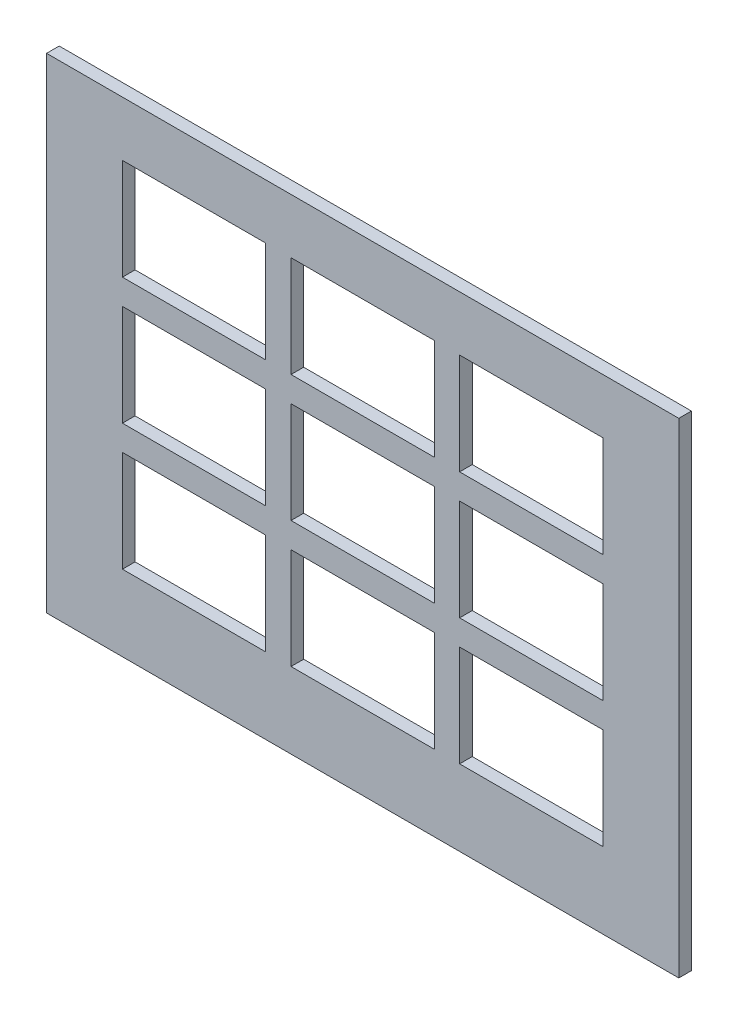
ISO-10303-21;
HEADER;
FILE_DESCRIPTION(('STEP AP214'),'2;1');
FILE_NAME('part.step','',(''),(''),'','','');
FILE_SCHEMA(('AUTOMOTIVE_DESIGN { 1 0 10303 214 1 1 1 1 }'));
ENDSEC;
DATA;
#1=APPLICATION_CONTEXT('core data for automotive mechanical design processes');
#2=APPLICATION_PROTOCOL_DEFINITION('international standard','automotive_design',2000,#1);
#3=PRODUCT_CONTEXT('',#1,'mechanical');
#4=PRODUCT('Part','Part','',(#3));
#5=PRODUCT_RELATED_PRODUCT_CATEGORY('part','',(#4));
#6=PRODUCT_DEFINITION_FORMATION('','',#4);
#7=PRODUCT_DEFINITION_CONTEXT('part definition',#1,'design');
#8=PRODUCT_DEFINITION('design','',#6,#7);
#9=PRODUCT_DEFINITION_SHAPE('','',#8);
#10=(LENGTH_UNIT() NAMED_UNIT(*) SI_UNIT(.MILLI.,.METRE.));
#11=(NAMED_UNIT(*) PLANE_ANGLE_UNIT() SI_UNIT($,.RADIAN.));
#12=(NAMED_UNIT(*) SI_UNIT($,.STERADIAN.) SOLID_ANGLE_UNIT());
#13=UNCERTAINTY_MEASURE_WITH_UNIT(LENGTH_MEASURE(1.E-05),#10,'distance_accuracy_value','');
#14=(GEOMETRIC_REPRESENTATION_CONTEXT(3) GLOBAL_UNCERTAINTY_ASSIGNED_CONTEXT((#13)) GLOBAL_UNIT_ASSIGNED_CONTEXT((#10,
#11,#12)) REPRESENTATION_CONTEXT('',''));
#15=CARTESIAN_POINT('',(0.,0.,0.));
#16=DIRECTION('',(0.,0.,1.));
#17=DIRECTION('',(1.,0.,0.));
#18=AXIS2_PLACEMENT_3D('',#15,#16,#17);
#19=CARTESIAN_POINT('',(0.,115.,3.));
#20=DIRECTION('',(0.,0.,-1.));
#21=DIRECTION('',(-1.,0.,0.));
#22=AXIS2_PLACEMENT_3D('',#19,#20,#21);
#23=PLANE('',#22);
#24=DIRECTION('',(1.,0.,0.));
#25=VECTOR('',#24,1.);
#26=CARTESIAN_POINT('',(17.9999999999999,48.,3.));
#27=LINE('',#26,#25);
#28=CARTESIAN_POINT('',(17.9999999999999,48.,3.));
#29=VERTEX_POINT('',#28);
#30=CARTESIAN_POINT('',(51.9999999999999,48.,3.));
#31=VERTEX_POINT('',#30);
#32=EDGE_CURVE('E330',#29,#31,#27,.T.);
#33=ORIENTED_EDGE('',*,*,#32,.F.);
#34=DIRECTION('',(0.,-1.,0.));
#35=VECTOR('',#34,1.);
#36=CARTESIAN_POINT('',(17.9999999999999,48.,3.));
#37=LINE('',#36,#35);
#38=CARTESIAN_POINT('',(17.9999999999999,72.,3.));
#39=VERTEX_POINT('',#38);
#40=EDGE_CURVE('E337',#39,#29,#37,.T.);
#41=ORIENTED_EDGE('',*,*,#40,.F.);
#42=DIRECTION('',(-1.,0.,0.));
#43=VECTOR('',#42,1.);
#44=CARTESIAN_POINT('',(17.9999999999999,72.,3.));
#45=LINE('',#44,#43);
#46=CARTESIAN_POINT('',(51.9999999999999,72.,3.));
#47=VERTEX_POINT('',#46);
#48=EDGE_CURVE('E334',#47,#39,#45,.T.);
#49=ORIENTED_EDGE('',*,*,#48,.F.);
#50=DIRECTION('',(0.,1.,0.));
#51=VECTOR('',#50,1.);
#52=CARTESIAN_POINT('',(51.9999999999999,48.,3.));
#53=LINE('',#52,#51);
#54=EDGE_CURVE('E332',#31,#47,#53,.T.);
#55=ORIENTED_EDGE('',*,*,#54,.F.);
#56=EDGE_LOOP('',(#33,#41,#49,#55));
#57=FACE_BOUND('',#56,.T.);
#58=DIRECTION('',(-1.,0.,0.));
#59=VECTOR('',#58,1.);
#60=CARTESIAN_POINT('',(91.9999999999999,102.,3.));
#61=LINE('',#60,#59);
#62=CARTESIAN_POINT('',(91.9999999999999,102.,3.));
#63=VERTEX_POINT('',#62);
#64=CARTESIAN_POINT('',(57.9999999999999,102.,3.));
#65=VERTEX_POINT('',#64);
#66=EDGE_CURVE('E392',#63,#65,#61,.T.);
#67=ORIENTED_EDGE('',*,*,#66,.F.);
#68=DIRECTION('',(0.,1.,0.));
#69=VECTOR('',#68,1.);
#70=CARTESIAN_POINT('',(91.9999999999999,102.,3.));
#71=LINE('',#70,#69);
#72=CARTESIAN_POINT('',(91.9999999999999,78.,3.));
#73=VERTEX_POINT('',#72);
#74=EDGE_CURVE('E399',#73,#63,#71,.T.);
#75=ORIENTED_EDGE('',*,*,#74,.F.);
#76=DIRECTION('',(1.,0.,0.));
#77=VECTOR('',#76,1.);
#78=CARTESIAN_POINT('',(91.9999999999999,78.,3.));
#79=LINE('',#78,#77);
#80=CARTESIAN_POINT('',(57.9999999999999,78.,3.));
#81=VERTEX_POINT('',#80);
#82=EDGE_CURVE('E396',#81,#73,#79,.T.);
#83=ORIENTED_EDGE('',*,*,#82,.F.);
#84=DIRECTION('',(0.,-1.,0.));
#85=VECTOR('',#84,1.);
#86=CARTESIAN_POINT('',(57.9999999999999,102.,3.));
#87=LINE('',#86,#85);
#88=EDGE_CURVE('E394',#65,#81,#87,.T.);
#89=ORIENTED_EDGE('',*,*,#88,.F.);
#90=EDGE_LOOP('',(#67,#75,#83,#89));
#91=FACE_BOUND('',#90,.T.);
#92=DIRECTION('',(-1.,0.,0.));
#93=VECTOR('',#92,1.);
#94=CARTESIAN_POINT('',(91.9999999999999,42.,3.));
#95=LINE('',#94,#93);
#96=CARTESIAN_POINT('',(91.9999999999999,42.,3.));
#97=VERTEX_POINT('',#96);
#98=CARTESIAN_POINT('',(57.9999999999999,41.9999999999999,3.));
#99=VERTEX_POINT('',#98);
#100=EDGE_CURVE('E454',#97,#99,#95,.T.);
#101=ORIENTED_EDGE('',*,*,#100,.F.);
#102=DIRECTION('',(0.,1.,0.));
#103=VECTOR('',#102,1.);
#104=CARTESIAN_POINT('',(91.9999999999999,42.,3.));
#105=LINE('',#104,#103);
#106=CARTESIAN_POINT('',(91.9999999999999,18.,3.));
#107=VERTEX_POINT('',#106);
#108=EDGE_CURVE('E461',#107,#97,#105,.T.);
#109=ORIENTED_EDGE('',*,*,#108,.F.);
#110=DIRECTION('',(1.,0.,0.));
#111=VECTOR('',#110,1.);
#112=CARTESIAN_POINT('',(91.9999999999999,18.,3.));
#113=LINE('',#112,#111);
#114=CARTESIAN_POINT('',(57.9999999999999,17.9999999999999,3.));
#115=VERTEX_POINT('',#114);
#116=EDGE_CURVE('E458',#115,#107,#113,.T.);
#117=ORIENTED_EDGE('',*,*,#116,.F.);
#118=DIRECTION('',(0.,-1.,0.));
#119=VECTOR('',#118,1.);
#120=CARTESIAN_POINT('',(57.9999999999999,41.9999999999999,3.));
#121=LINE('',#120,#119);
#122=EDGE_CURVE('E456',#99,#115,#121,.T.);
#123=ORIENTED_EDGE('',*,*,#122,.F.);
#124=EDGE_LOOP('',(#101,#109,#117,#123));
#125=FACE_BOUND('',#124,.T.);
#126=DIRECTION('',(1.,0.,0.));
#127=VECTOR('',#126,1.);
#128=CARTESIAN_POINT('',(97.9999999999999,48.,3.));
#129=LINE('',#128,#127);
#130=CARTESIAN_POINT('',(97.9999999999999,48.,3.));
#131=VERTEX_POINT('',#130);
#132=CARTESIAN_POINT('',(132.,48.,3.));
#133=VERTEX_POINT('',#132);
#134=EDGE_CURVE('E516',#131,#133,#129,.T.);
#135=ORIENTED_EDGE('',*,*,#134,.F.);
#136=DIRECTION('',(0.,-1.,0.));
#137=VECTOR('',#136,1.);
#138=CARTESIAN_POINT('',(97.9999999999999,48.,3.));
#139=LINE('',#138,#137);
#140=CARTESIAN_POINT('',(97.9999999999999,72.,3.));
#141=VERTEX_POINT('',#140);
#142=EDGE_CURVE('E523',#141,#131,#139,.T.);
#143=ORIENTED_EDGE('',*,*,#142,.F.);
#144=DIRECTION('',(-1.,0.,0.));
#145=VECTOR('',#144,1.);
#146=CARTESIAN_POINT('',(97.9999999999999,72.,3.));
#147=LINE('',#146,#145);
#148=CARTESIAN_POINT('',(132.,72.,3.));
#149=VERTEX_POINT('',#148);
#150=EDGE_CURVE('E520',#149,#141,#147,.T.);
#151=ORIENTED_EDGE('',*,*,#150,.F.);
#152=DIRECTION('',(0.,1.,0.));
#153=VECTOR('',#152,1.);
#154=CARTESIAN_POINT('',(132.,48.,3.));
#155=LINE('',#154,#153);
#156=EDGE_CURVE('E518',#133,#149,#155,.T.);
#157=ORIENTED_EDGE('',*,*,#156,.F.);
#158=EDGE_LOOP('',(#135,#143,#151,#157));
#159=FACE_BOUND('',#158,.T.);
#160=DIRECTION('',(0.,-1.,0.));
#161=VECTOR('',#160,1.);
#162=CARTESIAN_POINT('',(0.,0.,3.));
#163=LINE('',#162,#161);
#164=CARTESIAN_POINT('',(0.,115.,3.));
#165=VERTEX_POINT('',#164);
#166=CARTESIAN_POINT('',(0.,0.,3.));
#167=VERTEX_POINT('',#166);
#168=EDGE_CURVE('E575',#165,#167,#163,.T.);
#169=ORIENTED_EDGE('',*,*,#168,.T.);
#170=DIRECTION('',(1.,0.,0.));
#171=VECTOR('',#170,1.);
#172=CARTESIAN_POINT('',(0.,0.,3.));
#173=LINE('',#172,#171);
#174=CARTESIAN_POINT('',(150.,0.,3.));
#175=VERTEX_POINT('',#174);
#176=EDGE_CURVE('E578',#167,#175,#173,.T.);
#177=ORIENTED_EDGE('',*,*,#176,.T.);
#178=DIRECTION('',(0.,1.,0.));
#179=VECTOR('',#178,1.);
#180=CARTESIAN_POINT('',(150.,0.,3.));
#181=LINE('',#180,#179);
#182=CARTESIAN_POINT('',(150.,115.,3.));
#183=VERTEX_POINT('',#182);
#184=EDGE_CURVE('E580',#175,#183,#181,.T.);
#185=ORIENTED_EDGE('',*,*,#184,.T.);
#186=DIRECTION('',(-1.,0.,0.));
#187=VECTOR('',#186,1.);
#188=CARTESIAN_POINT('',(0.,115.,3.));
#189=LINE('',#188,#187);
#190=EDGE_CURVE('E582',#183,#165,#189,.T.);
#191=ORIENTED_EDGE('',*,*,#190,.T.);
#192=EDGE_LOOP('',(#169,#177,#185,#191));
#193=FACE_BOUND('',#192,.T.);
#194=DIRECTION('',(0.,-1.,0.));
#195=VECTOR('',#194,1.);
#196=CARTESIAN_POINT('',(97.9999999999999,102.,3.));
#197=LINE('',#196,#195);
#198=CARTESIAN_POINT('',(97.9999999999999,102.,3.));
#199=VERTEX_POINT('',#198);
#200=CARTESIAN_POINT('',(97.9999999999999,78.,3.));
#201=VERTEX_POINT('',#200);
#202=EDGE_CURVE('E547',#199,#201,#197,.T.);
#203=ORIENTED_EDGE('',*,*,#202,.F.);
#204=DIRECTION('',(-1.,0.,0.));
#205=VECTOR('',#204,1.);
#206=CARTESIAN_POINT('',(97.9999999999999,102.,3.));
#207=LINE('',#206,#205);
#208=CARTESIAN_POINT('',(132.,102.,3.));
#209=VERTEX_POINT('',#208);
#210=EDGE_CURVE('E554',#209,#199,#207,.T.);
#211=ORIENTED_EDGE('',*,*,#210,.F.);
#212=DIRECTION('',(0.,1.,0.));
#213=VECTOR('',#212,1.);
#214=CARTESIAN_POINT('',(132.,102.,3.));
#215=LINE('',#214,#213);
#216=CARTESIAN_POINT('',(132.,78.,3.));
#217=VERTEX_POINT('',#216);
#218=EDGE_CURVE('E551',#217,#209,#215,.T.);
#219=ORIENTED_EDGE('',*,*,#218,.F.);
#220=DIRECTION('',(1.,0.,0.));
#221=VECTOR('',#220,1.);
#222=CARTESIAN_POINT('',(97.9999999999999,78.,3.));
#223=LINE('',#222,#221);
#224=EDGE_CURVE('E549',#201,#217,#223,.T.);
#225=ORIENTED_EDGE('',*,*,#224,.F.);
#226=EDGE_LOOP('',(#203,#211,#219,#225));
#227=FACE_BOUND('',#226,.T.);
#228=DIRECTION('',(0.,-1.,0.));
#229=VECTOR('',#228,1.);
#230=CARTESIAN_POINT('',(97.9999999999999,42.,3.));
#231=LINE('',#230,#229);
#232=CARTESIAN_POINT('',(97.9999999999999,42.,3.));
#233=VERTEX_POINT('',#232);
#234=CARTESIAN_POINT('',(97.9999999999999,18.,3.));
#235=VERTEX_POINT('',#234);
#236=EDGE_CURVE('E485',#233,#235,#231,.T.);
#237=ORIENTED_EDGE('',*,*,#236,.F.);
#238=DIRECTION('',(-1.,0.,0.));
#239=VECTOR('',#238,1.);
#240=CARTESIAN_POINT('',(97.9999999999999,42.,3.));
#241=LINE('',#240,#239);
#242=CARTESIAN_POINT('',(132.,42.,3.));
#243=VERTEX_POINT('',#242);
#244=EDGE_CURVE('E492',#243,#233,#241,.T.);
#245=ORIENTED_EDGE('',*,*,#244,.F.);
#246=DIRECTION('',(0.,1.,0.));
#247=VECTOR('',#246,1.);
#248=CARTESIAN_POINT('',(132.,42.,3.));
#249=LINE('',#248,#247);
#250=CARTESIAN_POINT('',(132.,18.,3.));
#251=VERTEX_POINT('',#250);
#252=EDGE_CURVE('E489',#251,#243,#249,.T.);
#253=ORIENTED_EDGE('',*,*,#252,.F.);
#254=DIRECTION('',(1.,0.,0.));
#255=VECTOR('',#254,1.);
#256=CARTESIAN_POINT('',(97.9999999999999,18.,3.));
#257=LINE('',#256,#255);
#258=EDGE_CURVE('E487',#235,#251,#257,.T.);
#259=ORIENTED_EDGE('',*,*,#258,.F.);
#260=EDGE_LOOP('',(#237,#245,#253,#259));
#261=FACE_BOUND('',#260,.T.);
#262=DIRECTION('',(1.,0.,0.));
#263=VECTOR('',#262,1.);
#264=CARTESIAN_POINT('',(91.9999999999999,48.,3.));
#265=LINE('',#264,#263);
#266=CARTESIAN_POINT('',(57.9999999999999,48.,3.));
#267=VERTEX_POINT('',#266);
#268=CARTESIAN_POINT('',(91.9999999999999,48.,3.));
#269=VERTEX_POINT('',#268);
#270=EDGE_CURVE('E423',#267,#269,#265,.T.);
#271=ORIENTED_EDGE('',*,*,#270,.F.);
#272=DIRECTION('',(0.,-1.,0.));
#273=VECTOR('',#272,1.);
#274=CARTESIAN_POINT('',(57.9999999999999,48.,3.));
#275=LINE('',#274,#273);
#276=CARTESIAN_POINT('',(57.9999999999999,72.,3.));
#277=VERTEX_POINT('',#276);
#278=EDGE_CURVE('E430',#277,#267,#275,.T.);
#279=ORIENTED_EDGE('',*,*,#278,.F.);
#280=DIRECTION('',(-1.,0.,0.));
#281=VECTOR('',#280,1.);
#282=CARTESIAN_POINT('',(91.9999999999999,72.,3.));
#283=LINE('',#282,#281);
#284=CARTESIAN_POINT('',(91.9999999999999,72.,3.));
#285=VERTEX_POINT('',#284);
#286=EDGE_CURVE('E427',#285,#277,#283,.T.);
#287=ORIENTED_EDGE('',*,*,#286,.F.);
#288=DIRECTION('',(0.,1.,0.));
#289=VECTOR('',#288,1.);
#290=CARTESIAN_POINT('',(91.9999999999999,48.,3.));
#291=LINE('',#290,#289);
#292=EDGE_CURVE('E425',#269,#285,#291,.T.);
#293=ORIENTED_EDGE('',*,*,#292,.F.);
#294=EDGE_LOOP('',(#271,#279,#287,#293));
#295=FACE_BOUND('',#294,.T.);
#296=DIRECTION('',(-1.,0.,0.));
#297=VECTOR('',#296,1.);
#298=CARTESIAN_POINT('',(17.9999999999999,41.9999999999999,3.));
#299=LINE('',#298,#297);
#300=CARTESIAN_POINT('',(51.9999999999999,41.9999999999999,3.));
#301=VERTEX_POINT('',#300);
#302=CARTESIAN_POINT('',(17.9999999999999,41.9999999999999,3.));
#303=VERTEX_POINT('',#302);
#304=EDGE_CURVE('E361',#301,#303,#299,.T.);
#305=ORIENTED_EDGE('',*,*,#304,.F.);
#306=DIRECTION('',(0.,1.,0.));
#307=VECTOR('',#306,1.);
#308=CARTESIAN_POINT('',(51.9999999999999,41.9999999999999,3.));
#309=LINE('',#308,#307);
#310=CARTESIAN_POINT('',(51.9999999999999,17.9999999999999,3.));
#311=VERTEX_POINT('',#310);
#312=EDGE_CURVE('E368',#311,#301,#309,.T.);
#313=ORIENTED_EDGE('',*,*,#312,.F.);
#314=DIRECTION('',(1.,0.,0.));
#315=VECTOR('',#314,1.);
#316=CARTESIAN_POINT('',(17.9999999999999,17.9999999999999,3.));
#317=LINE('',#316,#315);
#318=CARTESIAN_POINT('',(17.9999999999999,17.9999999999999,3.));
#319=VERTEX_POINT('',#318);
#320=EDGE_CURVE('E365',#319,#311,#317,.T.);
#321=ORIENTED_EDGE('',*,*,#320,.F.);
#322=DIRECTION('',(0.,-1.,0.));
#323=VECTOR('',#322,1.);
#324=CARTESIAN_POINT('',(17.9999999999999,41.9999999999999,3.));
#325=LINE('',#324,#323);
#326=EDGE_CURVE('E363',#303,#319,#325,.T.);
#327=ORIENTED_EDGE('',*,*,#326,.F.);
#328=EDGE_LOOP('',(#305,#313,#321,#327));
#329=FACE_BOUND('',#328,.T.);
#330=DIRECTION('',(-1.,0.,0.));
#331=VECTOR('',#330,1.);
#332=CARTESIAN_POINT('',(17.9999999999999,102.,3.));
#333=LINE('',#332,#331);
#334=CARTESIAN_POINT('',(51.9999999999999,102.,3.));
#335=VERTEX_POINT('',#334);
#336=CARTESIAN_POINT('',(17.9999999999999,102.,3.));
#337=VERTEX_POINT('',#336);
#338=EDGE_CURVE('E298',#335,#337,#333,.T.);
#339=ORIENTED_EDGE('',*,*,#338,.F.);
#340=DIRECTION('',(0.,1.,0.));
#341=VECTOR('',#340,1.);
#342=CARTESIAN_POINT('',(51.9999999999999,102.,3.));
#343=LINE('',#342,#341);
#344=CARTESIAN_POINT('',(51.9999999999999,78.,3.));
#345=VERTEX_POINT('',#344);
#346=EDGE_CURVE('E313',#345,#335,#343,.T.);
#347=ORIENTED_EDGE('',*,*,#346,.F.);
#348=DIRECTION('',(1.,0.,0.));
#349=VECTOR('',#348,1.);
#350=CARTESIAN_POINT('',(17.9999999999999,78.,3.));
#351=LINE('',#350,#349);
#352=CARTESIAN_POINT('',(17.9999999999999,78.,3.));
#353=VERTEX_POINT('',#352);
#354=EDGE_CURVE('E311',#353,#345,#351,.T.);
#355=ORIENTED_EDGE('',*,*,#354,.F.);
#356=DIRECTION('',(0.,-1.,0.));
#357=VECTOR('',#356,1.);
#358=CARTESIAN_POINT('',(17.9999999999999,102.,3.));
#359=LINE('',#358,#357);
#360=EDGE_CURVE('E309',#337,#353,#359,.T.);
#361=ORIENTED_EDGE('',*,*,#360,.F.);
#362=EDGE_LOOP('',(#339,#347,#355,#361));
#363=FACE_BOUND('',#362,.T.);
#364=ADVANCED_FACE('F26',(#57,#91,#125,#159,#193,#227,#261,#295,#329,#363),#23,.F.);
#365=CARTESIAN_POINT('',(0.,115.,0.));
#366=DIRECTION('',(0.,0.,-1.));
#367=DIRECTION('',(-1.,0.,0.));
#368=AXIS2_PLACEMENT_3D('',#365,#366,#367);
#369=PLANE('',#368);
#370=DIRECTION('',(0.,-1.,0.));
#371=VECTOR('',#370,1.);
#372=CARTESIAN_POINT('',(17.9999999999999,48.,0.));
#373=LINE('',#372,#371);
#374=CARTESIAN_POINT('',(17.9999999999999,72.,0.));
#375=VERTEX_POINT('',#374);
#376=CARTESIAN_POINT('',(17.9999999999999,48.,0.));
#377=VERTEX_POINT('',#376);
#378=EDGE_CURVE('E327',#375,#377,#373,.T.);
#379=ORIENTED_EDGE('',*,*,#378,.T.);
#380=DIRECTION('',(1.,0.,0.));
#381=VECTOR('',#380,1.);
#382=CARTESIAN_POINT('',(17.9999999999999,48.,0.));
#383=LINE('',#382,#381);
#384=CARTESIAN_POINT('',(51.9999999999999,48.,0.));
#385=VERTEX_POINT('',#384);
#386=EDGE_CURVE('E299',#377,#385,#383,.T.);
#387=ORIENTED_EDGE('',*,*,#386,.T.);
#388=DIRECTION('',(0.,1.,0.));
#389=VECTOR('',#388,1.);
#390=CARTESIAN_POINT('',(51.9999999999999,48.,0.));
#391=LINE('',#390,#389);
#392=CARTESIAN_POINT('',(51.9999999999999,72.,0.));
#393=VERTEX_POINT('',#392);
#394=EDGE_CURVE('E321',#385,#393,#391,.T.);
#395=ORIENTED_EDGE('',*,*,#394,.T.);
#396=DIRECTION('',(-1.,0.,0.));
#397=VECTOR('',#396,1.);
#398=CARTESIAN_POINT('',(17.9999999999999,72.,0.));
#399=LINE('',#398,#397);
#400=EDGE_CURVE('E324',#393,#375,#399,.T.);
#401=ORIENTED_EDGE('',*,*,#400,.T.);
#402=EDGE_LOOP('',(#379,#387,#395,#401));
#403=FACE_BOUND('',#402,.T.);
#404=DIRECTION('',(0.,1.,0.));
#405=VECTOR('',#404,1.);
#406=CARTESIAN_POINT('',(91.9999999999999,102.,0.));
#407=LINE('',#406,#405);
#408=CARTESIAN_POINT('',(91.9999999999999,78.,0.));
#409=VERTEX_POINT('',#408);
#410=CARTESIAN_POINT('',(91.9999999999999,102.,0.));
#411=VERTEX_POINT('',#410);
#412=EDGE_CURVE('E389',#409,#411,#407,.T.);
#413=ORIENTED_EDGE('',*,*,#412,.T.);
#414=DIRECTION('',(-1.,0.,0.));
#415=VECTOR('',#414,1.);
#416=CARTESIAN_POINT('',(91.9999999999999,102.,0.));
#417=LINE('',#416,#415);
#418=CARTESIAN_POINT('',(57.9999999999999,102.,0.));
#419=VERTEX_POINT('',#418);
#420=EDGE_CURVE('E380',#411,#419,#417,.T.);
#421=ORIENTED_EDGE('',*,*,#420,.T.);
#422=DIRECTION('',(0.,-1.,0.));
#423=VECTOR('',#422,1.);
#424=CARTESIAN_POINT('',(57.9999999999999,102.,0.));
#425=LINE('',#424,#423);
#426=CARTESIAN_POINT('',(57.9999999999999,78.,0.));
#427=VERTEX_POINT('',#426);
#428=EDGE_CURVE('E383',#419,#427,#425,.T.);
#429=ORIENTED_EDGE('',*,*,#428,.T.);
#430=DIRECTION('',(1.,0.,0.));
#431=VECTOR('',#430,1.);
#432=CARTESIAN_POINT('',(91.9999999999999,78.,0.));
#433=LINE('',#432,#431);
#434=EDGE_CURVE('E386',#427,#409,#433,.T.);
#435=ORIENTED_EDGE('',*,*,#434,.T.);
#436=EDGE_LOOP('',(#413,#421,#429,#435));
#437=FACE_BOUND('',#436,.T.);
#438=DIRECTION('',(0.,1.,0.));
#439=VECTOR('',#438,1.);
#440=CARTESIAN_POINT('',(91.9999999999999,42.,0.));
#441=LINE('',#440,#439);
#442=CARTESIAN_POINT('',(91.9999999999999,18.,0.));
#443=VERTEX_POINT('',#442);
#444=CARTESIAN_POINT('',(91.9999999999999,42.,0.));
#445=VERTEX_POINT('',#444);
#446=EDGE_CURVE('E451',#443,#445,#441,.T.);
#447=ORIENTED_EDGE('',*,*,#446,.T.);
#448=DIRECTION('',(-1.,0.,0.));
#449=VECTOR('',#448,1.);
#450=CARTESIAN_POINT('',(91.9999999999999,42.,0.));
#451=LINE('',#450,#449);
#452=CARTESIAN_POINT('',(57.9999999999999,41.9999999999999,0.));
#453=VERTEX_POINT('',#452);
#454=EDGE_CURVE('E442',#445,#453,#451,.T.);
#455=ORIENTED_EDGE('',*,*,#454,.T.);
#456=DIRECTION('',(0.,-1.,0.));
#457=VECTOR('',#456,1.);
#458=CARTESIAN_POINT('',(57.9999999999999,41.9999999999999,0.));
#459=LINE('',#458,#457);
#460=CARTESIAN_POINT('',(57.9999999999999,17.9999999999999,0.));
#461=VERTEX_POINT('',#460);
#462=EDGE_CURVE('E445',#453,#461,#459,.T.);
#463=ORIENTED_EDGE('',*,*,#462,.T.);
#464=DIRECTION('',(1.,0.,0.));
#465=VECTOR('',#464,1.);
#466=CARTESIAN_POINT('',(91.9999999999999,18.,0.));
#467=LINE('',#466,#465);
#468=EDGE_CURVE('E448',#461,#443,#467,.T.);
#469=ORIENTED_EDGE('',*,*,#468,.T.);
#470=EDGE_LOOP('',(#447,#455,#463,#469));
#471=FACE_BOUND('',#470,.T.);
#472=DIRECTION('',(0.,-1.,0.));
#473=VECTOR('',#472,1.);
#474=CARTESIAN_POINT('',(97.9999999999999,48.,0.));
#475=LINE('',#474,#473);
#476=CARTESIAN_POINT('',(97.9999999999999,72.,0.));
#477=VERTEX_POINT('',#476);
#478=CARTESIAN_POINT('',(97.9999999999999,48.,0.));
#479=VERTEX_POINT('',#478);
#480=EDGE_CURVE('E513',#477,#479,#475,.T.);
#481=ORIENTED_EDGE('',*,*,#480,.T.);
#482=DIRECTION('',(1.,0.,0.));
#483=VECTOR('',#482,1.);
#484=CARTESIAN_POINT('',(97.9999999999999,48.,0.));
#485=LINE('',#484,#483);
#486=CARTESIAN_POINT('',(132.,48.,0.));
#487=VERTEX_POINT('',#486);
#488=EDGE_CURVE('E504',#479,#487,#485,.T.);
#489=ORIENTED_EDGE('',*,*,#488,.T.);
#490=DIRECTION('',(0.,1.,0.));
#491=VECTOR('',#490,1.);
#492=CARTESIAN_POINT('',(132.,48.,0.));
#493=LINE('',#492,#491);
#494=CARTESIAN_POINT('',(132.,72.,0.));
#495=VERTEX_POINT('',#494);
#496=EDGE_CURVE('E507',#487,#495,#493,.T.);
#497=ORIENTED_EDGE('',*,*,#496,.T.);
#498=DIRECTION('',(-1.,0.,0.));
#499=VECTOR('',#498,1.);
#500=CARTESIAN_POINT('',(97.9999999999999,72.,0.));
#501=LINE('',#500,#499);
#502=EDGE_CURVE('E510',#495,#477,#501,.T.);
#503=ORIENTED_EDGE('',*,*,#502,.T.);
#504=EDGE_LOOP('',(#481,#489,#497,#503));
#505=FACE_BOUND('',#504,.T.);
#506=DIRECTION('',(0.,-1.,0.));
#507=VECTOR('',#506,1.);
#508=CARTESIAN_POINT('',(0.,0.,0.));
#509=LINE('',#508,#507);
#510=CARTESIAN_POINT('',(0.,115.,0.));
#511=VERTEX_POINT('',#510);
#512=CARTESIAN_POINT('',(0.,0.,0.));
#513=VERTEX_POINT('',#512);
#514=EDGE_CURVE('E566',#511,#513,#509,.T.);
#515=ORIENTED_EDGE('',*,*,#514,.F.);
#516=DIRECTION('',(-1.,0.,0.));
#517=VECTOR('',#516,1.);
#518=CARTESIAN_POINT('',(0.,115.,0.));
#519=LINE('',#518,#517);
#520=CARTESIAN_POINT('',(150.,115.,0.));
#521=VERTEX_POINT('',#520);
#522=EDGE_CURVE('E573',#521,#511,#519,.T.);
#523=ORIENTED_EDGE('',*,*,#522,.F.);
#524=DIRECTION('',(0.,1.,0.));
#525=VECTOR('',#524,1.);
#526=CARTESIAN_POINT('',(150.,0.,0.));
#527=LINE('',#526,#525);
#528=CARTESIAN_POINT('',(150.,0.,0.));
#529=VERTEX_POINT('',#528);
#530=EDGE_CURVE('E571',#529,#521,#527,.T.);
#531=ORIENTED_EDGE('',*,*,#530,.F.);
#532=DIRECTION('',(1.,0.,0.));
#533=VECTOR('',#532,1.);
#534=CARTESIAN_POINT('',(0.,0.,0.));
#535=LINE('',#534,#533);
#536=EDGE_CURVE('E569',#513,#529,#535,.T.);
#537=ORIENTED_EDGE('',*,*,#536,.F.);
#538=EDGE_LOOP('',(#515,#523,#531,#537));
#539=FACE_BOUND('',#538,.T.);
#540=DIRECTION('',(-1.,0.,0.));
#541=VECTOR('',#540,1.);
#542=CARTESIAN_POINT('',(97.9999999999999,102.,0.));
#543=LINE('',#542,#541);
#544=CARTESIAN_POINT('',(132.,102.,0.));
#545=VERTEX_POINT('',#544);
#546=CARTESIAN_POINT('',(97.9999999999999,102.,0.));
#547=VERTEX_POINT('',#546);
#548=EDGE_CURVE('E544',#545,#547,#543,.T.);
#549=ORIENTED_EDGE('',*,*,#548,.T.);
#550=DIRECTION('',(0.,-1.,0.));
#551=VECTOR('',#550,1.);
#552=CARTESIAN_POINT('',(97.9999999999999,102.,0.));
#553=LINE('',#552,#551);
#554=CARTESIAN_POINT('',(97.9999999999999,78.,0.));
#555=VERTEX_POINT('',#554);
#556=EDGE_CURVE('E535',#547,#555,#553,.T.);
#557=ORIENTED_EDGE('',*,*,#556,.T.);
#558=DIRECTION('',(1.,0.,0.));
#559=VECTOR('',#558,1.);
#560=CARTESIAN_POINT('',(97.9999999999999,78.,0.));
#561=LINE('',#560,#559);
#562=CARTESIAN_POINT('',(132.,78.,0.));
#563=VERTEX_POINT('',#562);
#564=EDGE_CURVE('E538',#555,#563,#561,.T.);
#565=ORIENTED_EDGE('',*,*,#564,.T.);
#566=DIRECTION('',(0.,1.,0.));
#567=VECTOR('',#566,1.);
#568=CARTESIAN_POINT('',(132.,102.,0.));
#569=LINE('',#568,#567);
#570=EDGE_CURVE('E541',#563,#545,#569,.T.);
#571=ORIENTED_EDGE('',*,*,#570,.T.);
#572=EDGE_LOOP('',(#549,#557,#565,#571));
#573=FACE_BOUND('',#572,.T.);
#574=DIRECTION('',(-1.,0.,0.));
#575=VECTOR('',#574,1.);
#576=CARTESIAN_POINT('',(97.9999999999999,42.,0.));
#577=LINE('',#576,#575);
#578=CARTESIAN_POINT('',(132.,42.,0.));
#579=VERTEX_POINT('',#578);
#580=CARTESIAN_POINT('',(97.9999999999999,42.,0.));
#581=VERTEX_POINT('',#580);
#582=EDGE_CURVE('E482',#579,#581,#577,.T.);
#583=ORIENTED_EDGE('',*,*,#582,.T.);
#584=DIRECTION('',(0.,-1.,0.));
#585=VECTOR('',#584,1.);
#586=CARTESIAN_POINT('',(97.9999999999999,42.,0.));
#587=LINE('',#586,#585);
#588=CARTESIAN_POINT('',(97.9999999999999,18.,0.));
#589=VERTEX_POINT('',#588);
#590=EDGE_CURVE('E473',#581,#589,#587,.T.);
#591=ORIENTED_EDGE('',*,*,#590,.T.);
#592=DIRECTION('',(1.,0.,0.));
#593=VECTOR('',#592,1.);
#594=CARTESIAN_POINT('',(97.9999999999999,18.,0.));
#595=LINE('',#594,#593);
#596=CARTESIAN_POINT('',(132.,18.,0.));
#597=VERTEX_POINT('',#596);
#598=EDGE_CURVE('E476',#589,#597,#595,.T.);
#599=ORIENTED_EDGE('',*,*,#598,.T.);
#600=DIRECTION('',(0.,1.,0.));
#601=VECTOR('',#600,1.);
#602=CARTESIAN_POINT('',(132.,42.,0.));
#603=LINE('',#602,#601);
#604=EDGE_CURVE('E479',#597,#579,#603,.T.);
#605=ORIENTED_EDGE('',*,*,#604,.T.);
#606=EDGE_LOOP('',(#583,#591,#599,#605));
#607=FACE_BOUND('',#606,.T.);
#608=DIRECTION('',(0.,-1.,0.));
#609=VECTOR('',#608,1.);
#610=CARTESIAN_POINT('',(57.9999999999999,48.,0.));
#611=LINE('',#610,#609);
#612=CARTESIAN_POINT('',(57.9999999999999,72.,0.));
#613=VERTEX_POINT('',#612);
#614=CARTESIAN_POINT('',(57.9999999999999,48.,0.));
#615=VERTEX_POINT('',#614);
#616=EDGE_CURVE('E420',#613,#615,#611,.T.);
#617=ORIENTED_EDGE('',*,*,#616,.T.);
#618=DIRECTION('',(1.,0.,0.));
#619=VECTOR('',#618,1.);
#620=CARTESIAN_POINT('',(91.9999999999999,48.,0.));
#621=LINE('',#620,#619);
#622=CARTESIAN_POINT('',(91.9999999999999,48.,0.));
#623=VERTEX_POINT('',#622);
#624=EDGE_CURVE('E411',#615,#623,#621,.T.);
#625=ORIENTED_EDGE('',*,*,#624,.T.);
#626=DIRECTION('',(0.,1.,0.));
#627=VECTOR('',#626,1.);
#628=CARTESIAN_POINT('',(91.9999999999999,48.,0.));
#629=LINE('',#628,#627);
#630=CARTESIAN_POINT('',(91.9999999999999,72.,0.));
#631=VERTEX_POINT('',#630);
#632=EDGE_CURVE('E414',#623,#631,#629,.T.);
#633=ORIENTED_EDGE('',*,*,#632,.T.);
#634=DIRECTION('',(-1.,0.,0.));
#635=VECTOR('',#634,1.);
#636=CARTESIAN_POINT('',(91.9999999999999,72.,0.));
#637=LINE('',#636,#635);
#638=EDGE_CURVE('E417',#631,#613,#637,.T.);
#639=ORIENTED_EDGE('',*,*,#638,.T.);
#640=EDGE_LOOP('',(#617,#625,#633,#639));
#641=FACE_BOUND('',#640,.T.);
#642=DIRECTION('',(0.,1.,0.));
#643=VECTOR('',#642,1.);
#644=CARTESIAN_POINT('',(51.9999999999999,41.9999999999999,0.));
#645=LINE('',#644,#643);
#646=CARTESIAN_POINT('',(51.9999999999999,17.9999999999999,0.));
#647=VERTEX_POINT('',#646);
#648=CARTESIAN_POINT('',(51.9999999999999,41.9999999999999,0.));
#649=VERTEX_POINT('',#648);
#650=EDGE_CURVE('E358',#647,#649,#645,.T.);
#651=ORIENTED_EDGE('',*,*,#650,.T.);
#652=DIRECTION('',(-1.,0.,0.));
#653=VECTOR('',#652,1.);
#654=CARTESIAN_POINT('',(17.9999999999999,41.9999999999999,0.));
#655=LINE('',#654,#653);
#656=CARTESIAN_POINT('',(17.9999999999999,41.9999999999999,0.));
#657=VERTEX_POINT('',#656);
#658=EDGE_CURVE('E349',#649,#657,#655,.T.);
#659=ORIENTED_EDGE('',*,*,#658,.T.);
#660=DIRECTION('',(0.,-1.,0.));
#661=VECTOR('',#660,1.);
#662=CARTESIAN_POINT('',(17.9999999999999,41.9999999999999,0.));
#663=LINE('',#662,#661);
#664=CARTESIAN_POINT('',(17.9999999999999,17.9999999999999,0.));
#665=VERTEX_POINT('',#664);
#666=EDGE_CURVE('E352',#657,#665,#663,.T.);
#667=ORIENTED_EDGE('',*,*,#666,.T.);
#668=DIRECTION('',(1.,0.,0.));
#669=VECTOR('',#668,1.);
#670=CARTESIAN_POINT('',(17.9999999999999,17.9999999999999,0.));
#671=LINE('',#670,#669);
#672=EDGE_CURVE('E355',#665,#647,#671,.T.);
#673=ORIENTED_EDGE('',*,*,#672,.T.);
#674=EDGE_LOOP('',(#651,#659,#667,#673));
#675=FACE_BOUND('',#674,.T.);
#676=DIRECTION('',(0.,1.,0.));
#677=VECTOR('',#676,1.);
#678=CARTESIAN_POINT('',(51.9999999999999,102.,0.));
#679=LINE('',#678,#677);
#680=CARTESIAN_POINT('',(51.9999999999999,78.,0.));
#681=VERTEX_POINT('',#680);
#682=CARTESIAN_POINT('',(51.9999999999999,102.,0.));
#683=VERTEX_POINT('',#682);
#684=EDGE_CURVE('E303',#681,#683,#679,.T.);
#685=ORIENTED_EDGE('',*,*,#684,.T.);
#686=DIRECTION('',(-1.,0.,0.));
#687=VECTOR('',#686,1.);
#688=CARTESIAN_POINT('',(17.9999999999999,102.,0.));
#689=LINE('',#688,#687);
#690=CARTESIAN_POINT('',(17.9999999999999,102.,0.));
#691=VERTEX_POINT('',#690);
#692=EDGE_CURVE('E49',#683,#691,#689,.T.);
#693=ORIENTED_EDGE('',*,*,#692,.T.);
#694=DIRECTION('',(0.,-1.,0.));
#695=VECTOR('',#694,1.);
#696=CARTESIAN_POINT('',(17.9999999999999,102.,0.));
#697=LINE('',#696,#695);
#698=CARTESIAN_POINT('',(17.9999999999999,78.,0.));
#699=VERTEX_POINT('',#698);
#700=EDGE_CURVE('E285',#691,#699,#697,.T.);
#701=ORIENTED_EDGE('',*,*,#700,.T.);
#702=DIRECTION('',(1.,0.,0.));
#703=VECTOR('',#702,1.);
#704=CARTESIAN_POINT('',(17.9999999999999,78.,0.));
#705=LINE('',#704,#703);
#706=EDGE_CURVE('E294',#699,#681,#705,.T.);
#707=ORIENTED_EDGE('',*,*,#706,.T.);
#708=EDGE_LOOP('',(#685,#693,#701,#707));
#709=FACE_BOUND('',#708,.T.);
#710=ADVANCED_FACE('F302',(#403,#437,#471,#505,#539,#573,#607,#641,#675,#709),#369,.T.);
#711=CARTESIAN_POINT('',(0.,0.,3.));
#712=DIRECTION('',(1.,0.,0.));
#713=DIRECTION('',(0.,0.,-1.));
#714=AXIS2_PLACEMENT_3D('',#711,#712,#713);
#715=PLANE('',#714);
#716=ORIENTED_EDGE('',*,*,#514,.T.);
#717=DIRECTION('',(0.,0.,-1.));
#718=VECTOR('',#717,1.);
#719=CARTESIAN_POINT('',(0.,0.,3.));
#720=LINE('',#719,#718);
#721=EDGE_CURVE('E11',#167,#513,#720,.T.);
#722=ORIENTED_EDGE('',*,*,#721,.F.);
#723=ORIENTED_EDGE('',*,*,#168,.F.);
#724=DIRECTION('',(0.,0.,-1.));
#725=VECTOR('',#724,1.);
#726=CARTESIAN_POINT('',(0.,115.,3.));
#727=LINE('',#726,#725);
#728=EDGE_CURVE('E584',#165,#511,#727,.T.);
#729=ORIENTED_EDGE('',*,*,#728,.T.);
#730=EDGE_LOOP('',(#716,#722,#723,#729));
#731=FACE_BOUND('',#730,.T.);
#732=ADVANCED_FACE('F28',(#731),#715,.F.);
#733=CARTESIAN_POINT('',(0.,0.,3.));
#734=DIRECTION('',(0.,1.,0.));
#735=DIRECTION('',(0.,0.,1.));
#736=AXIS2_PLACEMENT_3D('',#733,#734,#735);
#737=PLANE('',#736);
#738=ORIENTED_EDGE('',*,*,#536,.T.);
#739=DIRECTION('',(0.,0.,-1.));
#740=VECTOR('',#739,1.);
#741=CARTESIAN_POINT('',(150.,0.,3.));
#742=LINE('',#741,#740);
#743=EDGE_CURVE('E34',#175,#529,#742,.T.);
#744=ORIENTED_EDGE('',*,*,#743,.F.);
#745=ORIENTED_EDGE('',*,*,#176,.F.);
#746=ORIENTED_EDGE('',*,*,#721,.T.);
#747=EDGE_LOOP('',(#738,#744,#745,#746));
#748=FACE_BOUND('',#747,.T.);
#749=ADVANCED_FACE('F610',(#748),#737,.F.);
#750=CARTESIAN_POINT('',(150.,0.,3.));
#751=DIRECTION('',(-1.,0.,0.));
#752=DIRECTION('',(0.,0.,1.));
#753=AXIS2_PLACEMENT_3D('',#750,#751,#752);
#754=PLANE('',#753);
#755=ORIENTED_EDGE('',*,*,#530,.T.);
#756=DIRECTION('',(0.,0.,-1.));
#757=VECTOR('',#756,1.);
#758=CARTESIAN_POINT('',(150.,115.,3.));
#759=LINE('',#758,#757);
#760=EDGE_CURVE('E587',#183,#521,#759,.T.);
#761=ORIENTED_EDGE('',*,*,#760,.F.);
#762=ORIENTED_EDGE('',*,*,#184,.F.);
#763=ORIENTED_EDGE('',*,*,#743,.T.);
#764=EDGE_LOOP('',(#755,#761,#762,#763));
#765=FACE_BOUND('',#764,.T.);
#766=ADVANCED_FACE('F594',(#765),#754,.F.);
#767=CARTESIAN_POINT('',(0.,115.,3.));
#768=DIRECTION('',(0.,-1.,0.));
#769=DIRECTION('',(0.,0.,-1.));
#770=AXIS2_PLACEMENT_3D('',#767,#768,#769);
#771=PLANE('',#770);
#772=ORIENTED_EDGE('',*,*,#522,.T.);
#773=ORIENTED_EDGE('',*,*,#728,.F.);
#774=ORIENTED_EDGE('',*,*,#190,.F.);
#775=ORIENTED_EDGE('',*,*,#760,.T.);
#776=EDGE_LOOP('',(#772,#773,#774,#775));
#777=FACE_BOUND('',#776,.T.);
#778=ADVANCED_FACE('F603',(#777),#771,.F.);
#779=CARTESIAN_POINT('',(97.9999999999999,102.,3.));
#780=DIRECTION('',(1.,0.,0.));
#781=DIRECTION('',(0.,0.,-1.));
#782=AXIS2_PLACEMENT_3D('',#779,#780,#781);
#783=PLANE('',#782);
#784=ORIENTED_EDGE('',*,*,#556,.F.);
#785=DIRECTION('',(0.,0.,-1.));
#786=VECTOR('',#785,1.);
#787=CARTESIAN_POINT('',(97.9999999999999,102.,3.));
#788=LINE('',#787,#786);
#789=EDGE_CURVE('E556',#199,#547,#788,.T.);
#790=ORIENTED_EDGE('',*,*,#789,.F.);
#791=ORIENTED_EDGE('',*,*,#202,.T.);
#792=DIRECTION('',(0.,0.,-1.));
#793=VECTOR('',#792,1.);
#794=CARTESIAN_POINT('',(97.9999999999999,78.,3.));
#795=LINE('',#794,#793);
#796=EDGE_CURVE('E563',#201,#555,#795,.T.);
#797=ORIENTED_EDGE('',*,*,#796,.T.);
#798=EDGE_LOOP('',(#784,#790,#791,#797));
#799=FACE_BOUND('',#798,.T.);
#800=ADVANCED_FACE('F630',(#799),#783,.T.);
#801=CARTESIAN_POINT('',(97.9999999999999,78.,3.));
#802=DIRECTION('',(0.,1.,0.));
#803=DIRECTION('',(0.,0.,1.));
#804=AXIS2_PLACEMENT_3D('',#801,#802,#803);
#805=PLANE('',#804);
#806=ORIENTED_EDGE('',*,*,#564,.F.);
#807=ORIENTED_EDGE('',*,*,#796,.F.);
#808=ORIENTED_EDGE('',*,*,#224,.T.);
#809=DIRECTION('',(0.,0.,-1.));
#810=VECTOR('',#809,1.);
#811=CARTESIAN_POINT('',(132.,78.,3.));
#812=LINE('',#811,#810);
#813=EDGE_CURVE('E561',#217,#563,#812,.T.);
#814=ORIENTED_EDGE('',*,*,#813,.T.);
#815=EDGE_LOOP('',(#806,#807,#808,#814));
#816=FACE_BOUND('',#815,.T.);
#817=ADVANCED_FACE('F634',(#816),#805,.T.);
#818=CARTESIAN_POINT('',(132.,102.,3.));
#819=DIRECTION('',(-1.,0.,0.));
#820=DIRECTION('',(0.,0.,1.));
#821=AXIS2_PLACEMENT_3D('',#818,#819,#820);
#822=PLANE('',#821);
#823=ORIENTED_EDGE('',*,*,#570,.F.);
#824=ORIENTED_EDGE('',*,*,#813,.F.);
#825=ORIENTED_EDGE('',*,*,#218,.T.);
#826=DIRECTION('',(0.,0.,-1.));
#827=VECTOR('',#826,1.);
#828=CARTESIAN_POINT('',(132.,102.,3.));
#829=LINE('',#828,#827);
#830=EDGE_CURVE('E559',#209,#545,#829,.T.);
#831=ORIENTED_EDGE('',*,*,#830,.T.);
#832=EDGE_LOOP('',(#823,#824,#825,#831));
#833=FACE_BOUND('',#832,.T.);
#834=ADVANCED_FACE('F639',(#833),#822,.T.);
#835=CARTESIAN_POINT('',(97.9999999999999,102.,3.));
#836=DIRECTION('',(0.,-1.,0.));
#837=DIRECTION('',(0.,0.,-1.));
#838=AXIS2_PLACEMENT_3D('',#835,#836,#837);
#839=PLANE('',#838);
#840=ORIENTED_EDGE('',*,*,#548,.F.);
#841=ORIENTED_EDGE('',*,*,#830,.F.);
#842=ORIENTED_EDGE('',*,*,#210,.T.);
#843=ORIENTED_EDGE('',*,*,#789,.T.);
#844=EDGE_LOOP('',(#840,#841,#842,#843));
#845=FACE_BOUND('',#844,.T.);
#846=ADVANCED_FACE('F645',(#845),#839,.T.);
#847=CARTESIAN_POINT('',(97.9999999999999,48.,3.));
#848=DIRECTION('',(0.,1.,0.));
#849=DIRECTION('',(0.,0.,1.));
#850=AXIS2_PLACEMENT_3D('',#847,#848,#849);
#851=PLANE('',#850);
#852=ORIENTED_EDGE('',*,*,#488,.F.);
#853=DIRECTION('',(0.,0.,-1.));
#854=VECTOR('',#853,1.);
#855=CARTESIAN_POINT('',(97.9999999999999,48.,3.));
#856=LINE('',#855,#854);
#857=EDGE_CURVE('E525',#131,#479,#856,.T.);
#858=ORIENTED_EDGE('',*,*,#857,.F.);
#859=ORIENTED_EDGE('',*,*,#134,.T.);
#860=DIRECTION('',(0.,0.,-1.));
#861=VECTOR('',#860,1.);
#862=CARTESIAN_POINT('',(132.,48.,3.));
#863=LINE('',#862,#861);
#864=EDGE_CURVE('E532',#133,#487,#863,.T.);
#865=ORIENTED_EDGE('',*,*,#864,.T.);
#866=EDGE_LOOP('',(#852,#858,#859,#865));
#867=FACE_BOUND('',#866,.T.);
#868=ADVANCED_FACE('F649',(#867),#851,.T.);
#869=CARTESIAN_POINT('',(132.,48.,3.));
#870=DIRECTION('',(-1.,0.,0.));
#871=DIRECTION('',(0.,0.,1.));
#872=AXIS2_PLACEMENT_3D('',#869,#870,#871);
#873=PLANE('',#872);
#874=ORIENTED_EDGE('',*,*,#496,.F.);
#875=ORIENTED_EDGE('',*,*,#864,.F.);
#876=ORIENTED_EDGE('',*,*,#156,.T.);
#877=DIRECTION('',(0.,0.,-1.));
#878=VECTOR('',#877,1.);
#879=CARTESIAN_POINT('',(132.,72.,3.));
#880=LINE('',#879,#878);
#881=EDGE_CURVE('E530',#149,#495,#880,.T.);
#882=ORIENTED_EDGE('',*,*,#881,.T.);
#883=EDGE_LOOP('',(#874,#875,#876,#882));
#884=FACE_BOUND('',#883,.T.);
#885=ADVANCED_FACE('F653',(#884),#873,.T.);
#886=CARTESIAN_POINT('',(97.9999999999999,72.,3.));
#887=DIRECTION('',(0.,-1.,0.));
#888=DIRECTION('',(0.,0.,-1.));
#889=AXIS2_PLACEMENT_3D('',#886,#887,#888);
#890=PLANE('',#889);
#891=ORIENTED_EDGE('',*,*,#502,.F.);
#892=ORIENTED_EDGE('',*,*,#881,.F.);
#893=ORIENTED_EDGE('',*,*,#150,.T.);
#894=DIRECTION('',(0.,0.,-1.));
#895=VECTOR('',#894,1.);
#896=CARTESIAN_POINT('',(97.9999999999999,72.,3.));
#897=LINE('',#896,#895);
#898=EDGE_CURVE('E528',#141,#477,#897,.T.);
#899=ORIENTED_EDGE('',*,*,#898,.T.);
#900=EDGE_LOOP('',(#891,#892,#893,#899));
#901=FACE_BOUND('',#900,.T.);
#902=ADVANCED_FACE('F657',(#901),#890,.T.);
#903=CARTESIAN_POINT('',(97.9999999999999,48.,3.));
#904=DIRECTION('',(1.,0.,0.));
#905=DIRECTION('',(0.,0.,-1.));
#906=AXIS2_PLACEMENT_3D('',#903,#904,#905);
#907=PLANE('',#906);
#908=ORIENTED_EDGE('',*,*,#480,.F.);
#909=ORIENTED_EDGE('',*,*,#898,.F.);
#910=ORIENTED_EDGE('',*,*,#142,.T.);
#911=ORIENTED_EDGE('',*,*,#857,.T.);
#912=EDGE_LOOP('',(#908,#909,#910,#911));
#913=FACE_BOUND('',#912,.T.);
#914=ADVANCED_FACE('F661',(#913),#907,.T.);
#915=CARTESIAN_POINT('',(97.9999999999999,42.,3.));
#916=DIRECTION('',(1.,0.,0.));
#917=DIRECTION('',(0.,0.,-1.));
#918=AXIS2_PLACEMENT_3D('',#915,#916,#917);
#919=PLANE('',#918);
#920=ORIENTED_EDGE('',*,*,#590,.F.);
#921=DIRECTION('',(0.,0.,-1.));
#922=VECTOR('',#921,1.);
#923=CARTESIAN_POINT('',(97.9999999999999,42.,3.));
#924=LINE('',#923,#922);
#925=EDGE_CURVE('E494',#233,#581,#924,.T.);
#926=ORIENTED_EDGE('',*,*,#925,.F.);
#927=ORIENTED_EDGE('',*,*,#236,.T.);
#928=DIRECTION('',(0.,0.,-1.));
#929=VECTOR('',#928,1.);
#930=CARTESIAN_POINT('',(97.9999999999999,18.,3.));
#931=LINE('',#930,#929);
#932=EDGE_CURVE('E501',#235,#589,#931,.T.);
#933=ORIENTED_EDGE('',*,*,#932,.T.);
#934=EDGE_LOOP('',(#920,#926,#927,#933));
#935=FACE_BOUND('',#934,.T.);
#936=ADVANCED_FACE('F665',(#935),#919,.T.);
#937=CARTESIAN_POINT('',(97.9999999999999,18.,3.));
#938=DIRECTION('',(0.,1.,0.));
#939=DIRECTION('',(0.,0.,1.));
#940=AXIS2_PLACEMENT_3D('',#937,#938,#939);
#941=PLANE('',#940);
#942=ORIENTED_EDGE('',*,*,#598,.F.);
#943=ORIENTED_EDGE('',*,*,#932,.F.);
#944=ORIENTED_EDGE('',*,*,#258,.T.);
#945=DIRECTION('',(0.,0.,-1.));
#946=VECTOR('',#945,1.);
#947=CARTESIAN_POINT('',(132.,18.,3.));
#948=LINE('',#947,#946);
#949=EDGE_CURVE('E499',#251,#597,#948,.T.);
#950=ORIENTED_EDGE('',*,*,#949,.T.);
#951=EDGE_LOOP('',(#942,#943,#944,#950));
#952=FACE_BOUND('',#951,.T.);
#953=ADVANCED_FACE('F669',(#952),#941,.T.);
#954=CARTESIAN_POINT('',(132.,42.,3.));
#955=DIRECTION('',(-1.,0.,0.));
#956=DIRECTION('',(0.,0.,1.));
#957=AXIS2_PLACEMENT_3D('',#954,#955,#956);
#958=PLANE('',#957);
#959=ORIENTED_EDGE('',*,*,#604,.F.);
#960=ORIENTED_EDGE('',*,*,#949,.F.);
#961=ORIENTED_EDGE('',*,*,#252,.T.);
#962=DIRECTION('',(0.,0.,-1.));
#963=VECTOR('',#962,1.);
#964=CARTESIAN_POINT('',(132.,42.,3.));
#965=LINE('',#964,#963);
#966=EDGE_CURVE('E497',#243,#579,#965,.T.);
#967=ORIENTED_EDGE('',*,*,#966,.T.);
#968=EDGE_LOOP('',(#959,#960,#961,#967));
#969=FACE_BOUND('',#968,.T.);
#970=ADVANCED_FACE('F673',(#969),#958,.T.);
#971=CARTESIAN_POINT('',(97.9999999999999,42.,3.));
#972=DIRECTION('',(0.,-1.,0.));
#973=DIRECTION('',(0.,0.,-1.));
#974=AXIS2_PLACEMENT_3D('',#971,#972,#973);
#975=PLANE('',#974);
#976=ORIENTED_EDGE('',*,*,#582,.F.);
#977=ORIENTED_EDGE('',*,*,#966,.F.);
#978=ORIENTED_EDGE('',*,*,#244,.T.);
#979=ORIENTED_EDGE('',*,*,#925,.T.);
#980=EDGE_LOOP('',(#976,#977,#978,#979));
#981=FACE_BOUND('',#980,.T.);
#982=ADVANCED_FACE('F677',(#981),#975,.T.);
#983=CARTESIAN_POINT('',(91.9999999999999,42.,3.));
#984=DIRECTION('',(0.,-1.,0.));
#985=DIRECTION('',(1.,0.,0.));
#986=AXIS2_PLACEMENT_3D('',#983,#984,#985);
#987=PLANE('',#986);
#988=ORIENTED_EDGE('',*,*,#454,.F.);
#989=DIRECTION('',(0.,0.,-1.));
#990=VECTOR('',#989,1.);
#991=CARTESIAN_POINT('',(91.9999999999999,42.,3.));
#992=LINE('',#991,#990);
#993=EDGE_CURVE('E463',#97,#445,#992,.T.);
#994=ORIENTED_EDGE('',*,*,#993,.F.);
#995=ORIENTED_EDGE('',*,*,#100,.T.);
#996=DIRECTION('',(0.,0.,-1.));
#997=VECTOR('',#996,1.);
#998=CARTESIAN_POINT('',(57.9999999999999,41.9999999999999,3.));
#999=LINE('',#998,#997);
#1000=EDGE_CURVE('E470',#99,#453,#999,.T.);
#1001=ORIENTED_EDGE('',*,*,#1000,.T.);
#1002=EDGE_LOOP('',(#988,#994,#995,#1001));
#1003=FACE_BOUND('',#1002,.T.);
#1004=ADVANCED_FACE('F681',(#1003),#987,.T.);
#1005=CARTESIAN_POINT('',(57.9999999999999,41.9999999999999,3.));
#1006=DIRECTION('',(1.,0.,0.));
#1007=DIRECTION('',(0.,1.,0.));
#1008=AXIS2_PLACEMENT_3D('',#1005,#1006,#1007);
#1009=PLANE('',#1008);
#1010=ORIENTED_EDGE('',*,*,#462,.F.);
#1011=ORIENTED_EDGE('',*,*,#1000,.F.);
#1012=ORIENTED_EDGE('',*,*,#122,.T.);
#1013=DIRECTION('',(0.,0.,-1.));
#1014=VECTOR('',#1013,1.);
#1015=CARTESIAN_POINT('',(57.9999999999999,17.9999999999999,3.));
#1016=LINE('',#1015,#1014);
#1017=EDGE_CURVE('E468',#115,#461,#1016,.T.);
#1018=ORIENTED_EDGE('',*,*,#1017,.T.);
#1019=EDGE_LOOP('',(#1010,#1011,#1012,#1018));
#1020=FACE_BOUND('',#1019,.T.);
#1021=ADVANCED_FACE('F685',(#1020),#1009,.T.);
#1022=CARTESIAN_POINT('',(91.9999999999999,18.,3.));
#1023=DIRECTION('',(0.,1.,0.));
#1024=DIRECTION('',(-1.,0.,0.));
#1025=AXIS2_PLACEMENT_3D('',#1022,#1023,#1024);
#1026=PLANE('',#1025);
#1027=ORIENTED_EDGE('',*,*,#468,.F.);
#1028=ORIENTED_EDGE('',*,*,#1017,.F.);
#1029=ORIENTED_EDGE('',*,*,#116,.T.);
#1030=DIRECTION('',(0.,0.,-1.));
#1031=VECTOR('',#1030,1.);
#1032=CARTESIAN_POINT('',(91.9999999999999,18.,3.));
#1033=LINE('',#1032,#1031);
#1034=EDGE_CURVE('E466',#107,#443,#1033,.T.);
#1035=ORIENTED_EDGE('',*,*,#1034,.T.);
#1036=EDGE_LOOP('',(#1027,#1028,#1029,#1035));
#1037=FACE_BOUND('',#1036,.T.);
#1038=ADVANCED_FACE('F689',(#1037),#1026,.T.);
#1039=CARTESIAN_POINT('',(91.9999999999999,42.,3.));
#1040=DIRECTION('',(-1.,0.,0.));
#1041=DIRECTION('',(0.,-1.,0.));
#1042=AXIS2_PLACEMENT_3D('',#1039,#1040,#1041);
#1043=PLANE('',#1042);
#1044=ORIENTED_EDGE('',*,*,#446,.F.);
#1045=ORIENTED_EDGE('',*,*,#1034,.F.);
#1046=ORIENTED_EDGE('',*,*,#108,.T.);
#1047=ORIENTED_EDGE('',*,*,#993,.T.);
#1048=EDGE_LOOP('',(#1044,#1045,#1046,#1047));
#1049=FACE_BOUND('',#1048,.T.);
#1050=ADVANCED_FACE('F693',(#1049),#1043,.T.);
#1051=CARTESIAN_POINT('',(91.9999999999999,48.,3.));
#1052=DIRECTION('',(0.,1.,0.));
#1053=DIRECTION('',(-1.,0.,0.));
#1054=AXIS2_PLACEMENT_3D('',#1051,#1052,#1053);
#1055=PLANE('',#1054);
#1056=ORIENTED_EDGE('',*,*,#624,.F.);
#1057=DIRECTION('',(0.,0.,-1.));
#1058=VECTOR('',#1057,1.);
#1059=CARTESIAN_POINT('',(57.9999999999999,48.,3.));
#1060=LINE('',#1059,#1058);
#1061=EDGE_CURVE('E432',#267,#615,#1060,.T.);
#1062=ORIENTED_EDGE('',*,*,#1061,.F.);
#1063=ORIENTED_EDGE('',*,*,#270,.T.);
#1064=DIRECTION('',(0.,0.,-1.));
#1065=VECTOR('',#1064,1.);
#1066=CARTESIAN_POINT('',(91.9999999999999,48.,3.));
#1067=LINE('',#1066,#1065);
#1068=EDGE_CURVE('E439',#269,#623,#1067,.T.);
#1069=ORIENTED_EDGE('',*,*,#1068,.T.);
#1070=EDGE_LOOP('',(#1056,#1062,#1063,#1069));
#1071=FACE_BOUND('',#1070,.T.);
#1072=ADVANCED_FACE('F697',(#1071),#1055,.T.);
#1073=CARTESIAN_POINT('',(91.9999999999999,48.,3.));
#1074=DIRECTION('',(-1.,0.,0.));
#1075=DIRECTION('',(0.,-1.,0.));
#1076=AXIS2_PLACEMENT_3D('',#1073,#1074,#1075);
#1077=PLANE('',#1076);
#1078=ORIENTED_EDGE('',*,*,#632,.F.);
#1079=ORIENTED_EDGE('',*,*,#1068,.F.);
#1080=ORIENTED_EDGE('',*,*,#292,.T.);
#1081=DIRECTION('',(0.,0.,-1.));
#1082=VECTOR('',#1081,1.);
#1083=CARTESIAN_POINT('',(91.9999999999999,72.,3.));
#1084=LINE('',#1083,#1082);
#1085=EDGE_CURVE('E437',#285,#631,#1084,.T.);
#1086=ORIENTED_EDGE('',*,*,#1085,.T.);
#1087=EDGE_LOOP('',(#1078,#1079,#1080,#1086));
#1088=FACE_BOUND('',#1087,.T.);
#1089=ADVANCED_FACE('F701',(#1088),#1077,.T.);
#1090=CARTESIAN_POINT('',(91.9999999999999,72.,3.));
#1091=DIRECTION('',(0.,-1.,0.));
#1092=DIRECTION('',(1.,0.,0.));
#1093=AXIS2_PLACEMENT_3D('',#1090,#1091,#1092);
#1094=PLANE('',#1093);
#1095=ORIENTED_EDGE('',*,*,#638,.F.);
#1096=ORIENTED_EDGE('',*,*,#1085,.F.);
#1097=ORIENTED_EDGE('',*,*,#286,.T.);
#1098=DIRECTION('',(0.,0.,-1.));
#1099=VECTOR('',#1098,1.);
#1100=CARTESIAN_POINT('',(57.9999999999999,72.,3.));
#1101=LINE('',#1100,#1099);
#1102=EDGE_CURVE('E435',#277,#613,#1101,.T.);
#1103=ORIENTED_EDGE('',*,*,#1102,.T.);
#1104=EDGE_LOOP('',(#1095,#1096,#1097,#1103));
#1105=FACE_BOUND('',#1104,.T.);
#1106=ADVANCED_FACE('F705',(#1105),#1094,.T.);
#1107=CARTESIAN_POINT('',(57.9999999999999,48.,3.));
#1108=DIRECTION('',(1.,0.,0.));
#1109=DIRECTION('',(0.,1.,0.));
#1110=AXIS2_PLACEMENT_3D('',#1107,#1108,#1109);
#1111=PLANE('',#1110);
#1112=ORIENTED_EDGE('',*,*,#616,.F.);
#1113=ORIENTED_EDGE('',*,*,#1102,.F.);
#1114=ORIENTED_EDGE('',*,*,#278,.T.);
#1115=ORIENTED_EDGE('',*,*,#1061,.T.);
#1116=EDGE_LOOP('',(#1112,#1113,#1114,#1115));
#1117=FACE_BOUND('',#1116,.T.);
#1118=ADVANCED_FACE('F709',(#1117),#1111,.T.);
#1119=CARTESIAN_POINT('',(91.9999999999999,102.,3.));
#1120=DIRECTION('',(0.,-1.,0.));
#1121=DIRECTION('',(1.,0.,0.));
#1122=AXIS2_PLACEMENT_3D('',#1119,#1120,#1121);
#1123=PLANE('',#1122);
#1124=ORIENTED_EDGE('',*,*,#420,.F.);
#1125=DIRECTION('',(0.,0.,-1.));
#1126=VECTOR('',#1125,1.);
#1127=CARTESIAN_POINT('',(91.9999999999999,102.,3.));
#1128=LINE('',#1127,#1126);
#1129=EDGE_CURVE('E401',#63,#411,#1128,.T.);
#1130=ORIENTED_EDGE('',*,*,#1129,.F.);
#1131=ORIENTED_EDGE('',*,*,#66,.T.);
#1132=DIRECTION('',(0.,0.,-1.));
#1133=VECTOR('',#1132,1.);
#1134=CARTESIAN_POINT('',(57.9999999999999,102.,3.));
#1135=LINE('',#1134,#1133);
#1136=EDGE_CURVE('E408',#65,#419,#1135,.T.);
#1137=ORIENTED_EDGE('',*,*,#1136,.T.);
#1138=EDGE_LOOP('',(#1124,#1130,#1131,#1137));
#1139=FACE_BOUND('',#1138,.T.);
#1140=ADVANCED_FACE('F713',(#1139),#1123,.T.);
#1141=CARTESIAN_POINT('',(57.9999999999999,102.,3.));
#1142=DIRECTION('',(1.,0.,0.));
#1143=DIRECTION('',(0.,1.,0.));
#1144=AXIS2_PLACEMENT_3D('',#1141,#1142,#1143);
#1145=PLANE('',#1144);
#1146=ORIENTED_EDGE('',*,*,#428,.F.);
#1147=ORIENTED_EDGE('',*,*,#1136,.F.);
#1148=ORIENTED_EDGE('',*,*,#88,.T.);
#1149=DIRECTION('',(0.,0.,-1.));
#1150=VECTOR('',#1149,1.);
#1151=CARTESIAN_POINT('',(57.9999999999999,78.,3.));
#1152=LINE('',#1151,#1150);
#1153=EDGE_CURVE('E406',#81,#427,#1152,.T.);
#1154=ORIENTED_EDGE('',*,*,#1153,.T.);
#1155=EDGE_LOOP('',(#1146,#1147,#1148,#1154));
#1156=FACE_BOUND('',#1155,.T.);
#1157=ADVANCED_FACE('F717',(#1156),#1145,.T.);
#1158=CARTESIAN_POINT('',(91.9999999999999,78.,3.));
#1159=DIRECTION('',(0.,1.,0.));
#1160=DIRECTION('',(-1.,0.,0.));
#1161=AXIS2_PLACEMENT_3D('',#1158,#1159,#1160);
#1162=PLANE('',#1161);
#1163=ORIENTED_EDGE('',*,*,#434,.F.);
#1164=ORIENTED_EDGE('',*,*,#1153,.F.);
#1165=ORIENTED_EDGE('',*,*,#82,.T.);
#1166=DIRECTION('',(0.,0.,-1.));
#1167=VECTOR('',#1166,1.);
#1168=CARTESIAN_POINT('',(91.9999999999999,78.,3.));
#1169=LINE('',#1168,#1167);
#1170=EDGE_CURVE('E404',#73,#409,#1169,.T.);
#1171=ORIENTED_EDGE('',*,*,#1170,.T.);
#1172=EDGE_LOOP('',(#1163,#1164,#1165,#1171));
#1173=FACE_BOUND('',#1172,.T.);
#1174=ADVANCED_FACE('F721',(#1173),#1162,.T.);
#1175=CARTESIAN_POINT('',(91.9999999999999,102.,3.));
#1176=DIRECTION('',(-1.,0.,0.));
#1177=DIRECTION('',(0.,-1.,0.));
#1178=AXIS2_PLACEMENT_3D('',#1175,#1176,#1177);
#1179=PLANE('',#1178);
#1180=ORIENTED_EDGE('',*,*,#412,.F.);
#1181=ORIENTED_EDGE('',*,*,#1170,.F.);
#1182=ORIENTED_EDGE('',*,*,#74,.T.);
#1183=ORIENTED_EDGE('',*,*,#1129,.T.);
#1184=EDGE_LOOP('',(#1180,#1181,#1182,#1183));
#1185=FACE_BOUND('',#1184,.T.);
#1186=ADVANCED_FACE('F725',(#1185),#1179,.T.);
#1187=CARTESIAN_POINT('',(17.9999999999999,41.9999999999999,3.));
#1188=DIRECTION('',(0.,-1.,0.));
#1189=DIRECTION('',(0.,0.,-1.));
#1190=AXIS2_PLACEMENT_3D('',#1187,#1188,#1189);
#1191=PLANE('',#1190);
#1192=ORIENTED_EDGE('',*,*,#658,.F.);
#1193=DIRECTION('',(0.,0.,-1.));
#1194=VECTOR('',#1193,1.);
#1195=CARTESIAN_POINT('',(51.9999999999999,41.9999999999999,3.));
#1196=LINE('',#1195,#1194);
#1197=EDGE_CURVE('E370',#301,#649,#1196,.T.);
#1198=ORIENTED_EDGE('',*,*,#1197,.F.);
#1199=ORIENTED_EDGE('',*,*,#304,.T.);
#1200=DIRECTION('',(0.,0.,-1.));
#1201=VECTOR('',#1200,1.);
#1202=CARTESIAN_POINT('',(17.9999999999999,41.9999999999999,3.));
#1203=LINE('',#1202,#1201);
#1204=EDGE_CURVE('E377',#303,#657,#1203,.T.);
#1205=ORIENTED_EDGE('',*,*,#1204,.T.);
#1206=EDGE_LOOP('',(#1192,#1198,#1199,#1205));
#1207=FACE_BOUND('',#1206,.T.);
#1208=ADVANCED_FACE('F729',(#1207),#1191,.T.);
#1209=CARTESIAN_POINT('',(17.9999999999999,41.9999999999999,3.));
#1210=DIRECTION('',(1.,0.,0.));
#1211=DIRECTION('',(0.,0.,-1.));
#1212=AXIS2_PLACEMENT_3D('',#1209,#1210,#1211);
#1213=PLANE('',#1212);
#1214=ORIENTED_EDGE('',*,*,#666,.F.);
#1215=ORIENTED_EDGE('',*,*,#1204,.F.);
#1216=ORIENTED_EDGE('',*,*,#326,.T.);
#1217=DIRECTION('',(0.,0.,-1.));
#1218=VECTOR('',#1217,1.);
#1219=CARTESIAN_POINT('',(17.9999999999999,17.9999999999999,3.));
#1220=LINE('',#1219,#1218);
#1221=EDGE_CURVE('E375',#319,#665,#1220,.T.);
#1222=ORIENTED_EDGE('',*,*,#1221,.T.);
#1223=EDGE_LOOP('',(#1214,#1215,#1216,#1222));
#1224=FACE_BOUND('',#1223,.T.);
#1225=ADVANCED_FACE('F733',(#1224),#1213,.T.);
#1226=CARTESIAN_POINT('',(17.9999999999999,17.9999999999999,3.));
#1227=DIRECTION('',(0.,1.,0.));
#1228=DIRECTION('',(0.,0.,1.));
#1229=AXIS2_PLACEMENT_3D('',#1226,#1227,#1228);
#1230=PLANE('',#1229);
#1231=ORIENTED_EDGE('',*,*,#672,.F.);
#1232=ORIENTED_EDGE('',*,*,#1221,.F.);
#1233=ORIENTED_EDGE('',*,*,#320,.T.);
#1234=DIRECTION('',(0.,0.,-1.));
#1235=VECTOR('',#1234,1.);
#1236=CARTESIAN_POINT('',(51.9999999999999,17.9999999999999,3.));
#1237=LINE('',#1236,#1235);
#1238=EDGE_CURVE('E373',#311,#647,#1237,.T.);
#1239=ORIENTED_EDGE('',*,*,#1238,.T.);
#1240=EDGE_LOOP('',(#1231,#1232,#1233,#1239));
#1241=FACE_BOUND('',#1240,.T.);
#1242=ADVANCED_FACE('F737',(#1241),#1230,.T.);
#1243=CARTESIAN_POINT('',(51.9999999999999,41.9999999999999,3.));
#1244=DIRECTION('',(-1.,0.,0.));
#1245=DIRECTION('',(0.,-1.,0.));
#1246=AXIS2_PLACEMENT_3D('',#1243,#1244,#1245);
#1247=PLANE('',#1246);
#1248=ORIENTED_EDGE('',*,*,#650,.F.);
#1249=ORIENTED_EDGE('',*,*,#1238,.F.);
#1250=ORIENTED_EDGE('',*,*,#312,.T.);
#1251=ORIENTED_EDGE('',*,*,#1197,.T.);
#1252=EDGE_LOOP('',(#1248,#1249,#1250,#1251));
#1253=FACE_BOUND('',#1252,.T.);
#1254=ADVANCED_FACE('F741',(#1253),#1247,.T.);
#1255=CARTESIAN_POINT('',(17.9999999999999,48.,3.));
#1256=DIRECTION('',(0.,1.,0.));
#1257=DIRECTION('',(0.,0.,1.));
#1258=AXIS2_PLACEMENT_3D('',#1255,#1256,#1257);
#1259=PLANE('',#1258);
#1260=ORIENTED_EDGE('',*,*,#386,.F.);
#1261=DIRECTION('',(0.,0.,-1.));
#1262=VECTOR('',#1261,1.);
#1263=CARTESIAN_POINT('',(17.9999999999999,48.,3.));
#1264=LINE('',#1263,#1262);
#1265=EDGE_CURVE('E339',#29,#377,#1264,.T.);
#1266=ORIENTED_EDGE('',*,*,#1265,.F.);
#1267=ORIENTED_EDGE('',*,*,#32,.T.);
#1268=DIRECTION('',(0.,0.,-1.));
#1269=VECTOR('',#1268,1.);
#1270=CARTESIAN_POINT('',(51.9999999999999,48.,3.));
#1271=LINE('',#1270,#1269);
#1272=EDGE_CURVE('E346',#31,#385,#1271,.T.);
#1273=ORIENTED_EDGE('',*,*,#1272,.T.);
#1274=EDGE_LOOP('',(#1260,#1266,#1267,#1273));
#1275=FACE_BOUND('',#1274,.T.);
#1276=ADVANCED_FACE('F745',(#1275),#1259,.T.);
#1277=CARTESIAN_POINT('',(51.9999999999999,48.,3.));
#1278=DIRECTION('',(-1.,0.,0.));
#1279=DIRECTION('',(0.,-1.,0.));
#1280=AXIS2_PLACEMENT_3D('',#1277,#1278,#1279);
#1281=PLANE('',#1280);
#1282=ORIENTED_EDGE('',*,*,#394,.F.);
#1283=ORIENTED_EDGE('',*,*,#1272,.F.);
#1284=ORIENTED_EDGE('',*,*,#54,.T.);
#1285=DIRECTION('',(0.,0.,-1.));
#1286=VECTOR('',#1285,1.);
#1287=CARTESIAN_POINT('',(51.9999999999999,72.,3.));
#1288=LINE('',#1287,#1286);
#1289=EDGE_CURVE('E344',#47,#393,#1288,.T.);
#1290=ORIENTED_EDGE('',*,*,#1289,.T.);
#1291=EDGE_LOOP('',(#1282,#1283,#1284,#1290));
#1292=FACE_BOUND('',#1291,.T.);
#1293=ADVANCED_FACE('F749',(#1292),#1281,.T.);
#1294=CARTESIAN_POINT('',(17.9999999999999,72.,3.));
#1295=DIRECTION('',(0.,-1.,0.));
#1296=DIRECTION('',(0.,0.,-1.));
#1297=AXIS2_PLACEMENT_3D('',#1294,#1295,#1296);
#1298=PLANE('',#1297);
#1299=ORIENTED_EDGE('',*,*,#400,.F.);
#1300=ORIENTED_EDGE('',*,*,#1289,.F.);
#1301=ORIENTED_EDGE('',*,*,#48,.T.);
#1302=DIRECTION('',(0.,0.,-1.));
#1303=VECTOR('',#1302,1.);
#1304=CARTESIAN_POINT('',(17.9999999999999,72.,3.));
#1305=LINE('',#1304,#1303);
#1306=EDGE_CURVE('E342',#39,#375,#1305,.T.);
#1307=ORIENTED_EDGE('',*,*,#1306,.T.);
#1308=EDGE_LOOP('',(#1299,#1300,#1301,#1307));
#1309=FACE_BOUND('',#1308,.T.);
#1310=ADVANCED_FACE('F753',(#1309),#1298,.T.);
#1311=CARTESIAN_POINT('',(17.9999999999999,48.,3.));
#1312=DIRECTION('',(1.,0.,0.));
#1313=DIRECTION('',(0.,0.,-1.));
#1314=AXIS2_PLACEMENT_3D('',#1311,#1312,#1313);
#1315=PLANE('',#1314);
#1316=ORIENTED_EDGE('',*,*,#378,.F.);
#1317=ORIENTED_EDGE('',*,*,#1306,.F.);
#1318=ORIENTED_EDGE('',*,*,#40,.T.);
#1319=ORIENTED_EDGE('',*,*,#1265,.T.);
#1320=EDGE_LOOP('',(#1316,#1317,#1318,#1319));
#1321=FACE_BOUND('',#1320,.T.);
#1322=ADVANCED_FACE('F757',(#1321),#1315,.T.);
#1323=CARTESIAN_POINT('',(17.9999999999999,102.,3.));
#1324=DIRECTION('',(0.,-1.,0.));
#1325=DIRECTION('',(0.,0.,-1.));
#1326=AXIS2_PLACEMENT_3D('',#1323,#1324,#1325);
#1327=PLANE('',#1326);
#1328=ORIENTED_EDGE('',*,*,#692,.F.);
#1329=DIRECTION('',(0.,0.,-1.));
#1330=VECTOR('',#1329,1.);
#1331=CARTESIAN_POINT('',(51.9999999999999,102.,3.));
#1332=LINE('',#1331,#1330);
#1333=EDGE_CURVE('E315',#335,#683,#1332,.T.);
#1334=ORIENTED_EDGE('',*,*,#1333,.F.);
#1335=ORIENTED_EDGE('',*,*,#338,.T.);
#1336=DIRECTION('',(0.,0.,-1.));
#1337=VECTOR('',#1336,1.);
#1338=CARTESIAN_POINT('',(17.9999999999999,102.,3.));
#1339=LINE('',#1338,#1337);
#1340=EDGE_CURVE('E287',#337,#691,#1339,.T.);
#1341=ORIENTED_EDGE('',*,*,#1340,.T.);
#1342=EDGE_LOOP('',(#1328,#1334,#1335,#1341));
#1343=FACE_BOUND('',#1342,.T.);
#1344=ADVANCED_FACE('F296',(#1343),#1327,.T.);
#1345=CARTESIAN_POINT('',(17.9999999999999,102.,3.));
#1346=DIRECTION('',(1.,0.,0.));
#1347=DIRECTION('',(0.,0.,-1.));
#1348=AXIS2_PLACEMENT_3D('',#1345,#1346,#1347);
#1349=PLANE('',#1348);
#1350=ORIENTED_EDGE('',*,*,#700,.F.);
#1351=ORIENTED_EDGE('',*,*,#1340,.F.);
#1352=ORIENTED_EDGE('',*,*,#360,.T.);
#1353=DIRECTION('',(0.,0.,-1.));
#1354=VECTOR('',#1353,1.);
#1355=CARTESIAN_POINT('',(17.9999999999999,78.,3.));
#1356=LINE('',#1355,#1354);
#1357=EDGE_CURVE('E290',#353,#699,#1356,.T.);
#1358=ORIENTED_EDGE('',*,*,#1357,.T.);
#1359=EDGE_LOOP('',(#1350,#1351,#1352,#1358));
#1360=FACE_BOUND('',#1359,.T.);
#1361=ADVANCED_FACE('F286',(#1360),#1349,.T.);
#1362=CARTESIAN_POINT('',(17.9999999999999,78.,3.));
#1363=DIRECTION('',(0.,1.,0.));
#1364=DIRECTION('',(0.,0.,1.));
#1365=AXIS2_PLACEMENT_3D('',#1362,#1363,#1364);
#1366=PLANE('',#1365);
#1367=ORIENTED_EDGE('',*,*,#706,.F.);
#1368=ORIENTED_EDGE('',*,*,#1357,.F.);
#1369=ORIENTED_EDGE('',*,*,#354,.T.);
#1370=DIRECTION('',(0.,0.,-1.));
#1371=VECTOR('',#1370,1.);
#1372=CARTESIAN_POINT('',(51.9999999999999,78.,3.));
#1373=LINE('',#1372,#1371);
#1374=EDGE_CURVE('E41',#345,#681,#1373,.T.);
#1375=ORIENTED_EDGE('',*,*,#1374,.T.);
#1376=EDGE_LOOP('',(#1367,#1368,#1369,#1375));
#1377=FACE_BOUND('',#1376,.T.);
#1378=ADVANCED_FACE('F766',(#1377),#1366,.T.);
#1379=CARTESIAN_POINT('',(51.9999999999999,102.,3.));
#1380=DIRECTION('',(-1.,0.,0.));
#1381=DIRECTION('',(0.,-1.,0.));
#1382=AXIS2_PLACEMENT_3D('',#1379,#1380,#1381);
#1383=PLANE('',#1382);
#1384=ORIENTED_EDGE('',*,*,#684,.F.);
#1385=ORIENTED_EDGE('',*,*,#1374,.F.);
#1386=ORIENTED_EDGE('',*,*,#346,.T.);
#1387=ORIENTED_EDGE('',*,*,#1333,.T.);
#1388=EDGE_LOOP('',(#1384,#1385,#1386,#1387));
#1389=FACE_BOUND('',#1388,.T.);
#1390=ADVANCED_FACE('F769',(#1389),#1383,.T.);
#1391=CLOSED_SHELL('',(#364,#710,#732,#749,#766,#778,#800,#817,#834,#846,#868,#885,#902,#914,
#936,#953,#970,#982,#1004,#1021,#1038,#1050,#1072,#1089,#1106,#1118,#1140,#1157,#1174,#1186,
#1208,#1225,#1242,#1254,#1276,#1293,#1310,#1322,#1344,#1361,#1378,#1390));
#1392=MANIFOLD_SOLID_BREP('B2',#1391);
#1393=ADVANCED_BREP_SHAPE_REPRESENTATION('',(#18,#1392),#14);
#1394=SHAPE_DEFINITION_REPRESENTATION(#9,#1393);
ENDSEC;
END-ISO-10303-21;
